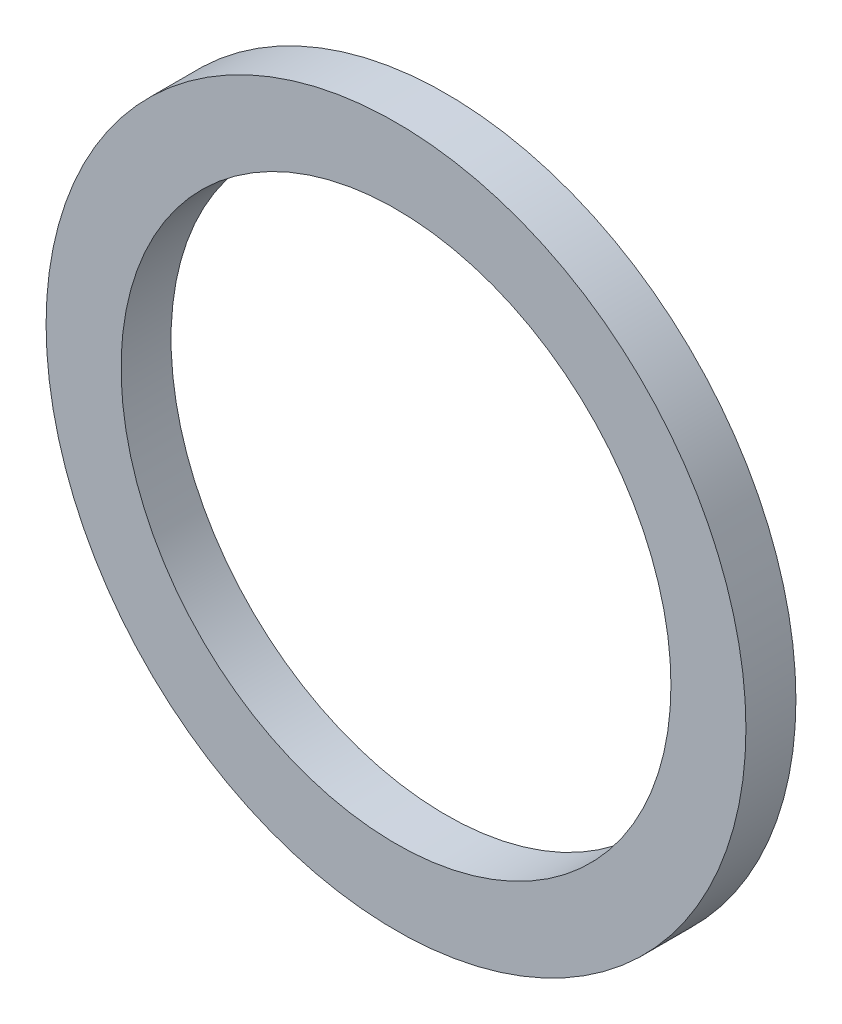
ISO-10303-21;
HEADER;
FILE_DESCRIPTION(('STEP AP214'),'2;1');
FILE_NAME('part.step','',(''),(''),'','','');
FILE_SCHEMA(('AUTOMOTIVE_DESIGN { 1 0 10303 214 1 1 1 1 }'));
ENDSEC;
DATA;
#1=APPLICATION_CONTEXT('core data for automotive mechanical design processes');
#2=APPLICATION_PROTOCOL_DEFINITION('international standard','automotive_design',2000,#1);
#3=PRODUCT_CONTEXT('',#1,'mechanical');
#4=PRODUCT('Part','Part','',(#3));
#5=PRODUCT_RELATED_PRODUCT_CATEGORY('part','',(#4));
#6=PRODUCT_DEFINITION_FORMATION('','',#4);
#7=PRODUCT_DEFINITION_CONTEXT('part definition',#1,'design');
#8=PRODUCT_DEFINITION('design','',#6,#7);
#9=PRODUCT_DEFINITION_SHAPE('','',#8);
#10=(LENGTH_UNIT() NAMED_UNIT(*) SI_UNIT(.MILLI.,.METRE.));
#11=(NAMED_UNIT(*) PLANE_ANGLE_UNIT() SI_UNIT($,.RADIAN.));
#12=(NAMED_UNIT(*) SI_UNIT($,.STERADIAN.) SOLID_ANGLE_UNIT());
#13=UNCERTAINTY_MEASURE_WITH_UNIT(LENGTH_MEASURE(1.E-05),#10,'distance_accuracy_value','');
#14=(GEOMETRIC_REPRESENTATION_CONTEXT(3) GLOBAL_UNCERTAINTY_ASSIGNED_CONTEXT((#13)) GLOBAL_UNIT_ASSIGNED_CONTEXT((#10,
#11,#12)) REPRESENTATION_CONTEXT('',''));
#15=CARTESIAN_POINT('',(0.,0.,0.));
#16=DIRECTION('',(0.,0.,1.));
#17=DIRECTION('',(1.,0.,0.));
#18=AXIS2_PLACEMENT_3D('',#15,#16,#17);
#19=CARTESIAN_POINT('',(0.,27.5,0.));
#20=DIRECTION('',(0.,0.,-1.));
#21=DIRECTION('',(-1.,0.,0.));
#22=AXIS2_PLACEMENT_3D('',#19,#20,#21);
#23=PLANE('',#22);
#24=CARTESIAN_POINT('',(0.,0.,0.));
#25=DIRECTION('',(0.,0.,1.));
#26=DIRECTION('',(1.,0.,0.));
#27=AXIS2_PLACEMENT_3D('',#24,#25,#26);
#28=CIRCLE('',#27,27.5);
#29=CARTESIAN_POINT('',(27.5,0.,0.));
#30=VERTEX_POINT('',#29);
#31=EDGE_CURVE('E45',#30,#30,#28,.T.);
#32=ORIENTED_EDGE('',*,*,#31,.F.);
#33=EDGE_LOOP('',(#32));
#34=FACE_BOUND('',#33,.T.);
#35=CARTESIAN_POINT('',(0.,0.,0.));
#36=DIRECTION('',(0.,0.,1.));
#37=DIRECTION('',(1.,0.,0.));
#38=AXIS2_PLACEMENT_3D('',#35,#36,#37);
#39=CIRCLE('',#38,35.);
#40=CARTESIAN_POINT('',(35.,0.,0.));
#41=VERTEX_POINT('',#40);
#42=EDGE_CURVE('E10',#41,#41,#39,.T.);
#43=ORIENTED_EDGE('',*,*,#42,.T.);
#44=EDGE_LOOP('',(#43));
#45=FACE_BOUND('',#44,.T.);
#46=ADVANCED_FACE('F31',(#34,#45),#23,.F.);
#47=CARTESIAN_POINT('',(0.,0.,0.));
#48=DIRECTION('',(0.,0.,1.));
#49=DIRECTION('',(1.,0.,0.));
#50=AXIS2_PLACEMENT_3D('',#47,#48,#49);
#51=CYLINDRICAL_SURFACE('',#50,35.);
#52=ORIENTED_EDGE('',*,*,#42,.F.);
#53=EDGE_LOOP('',(#52));
#54=FACE_BOUND('',#53,.T.);
#55=CARTESIAN_POINT('',(0.,0.,-5.));
#56=DIRECTION('',(0.,0.,1.));
#57=DIRECTION('',(1.,0.,0.));
#58=AXIS2_PLACEMENT_3D('',#55,#56,#57);
#59=CIRCLE('',#58,35.);
#60=CARTESIAN_POINT('',(35.,0.,-5.));
#61=VERTEX_POINT('',#60);
#62=EDGE_CURVE('E37',#61,#61,#59,.T.);
#63=ORIENTED_EDGE('',*,*,#62,.T.);
#64=EDGE_LOOP('',(#63));
#65=FACE_BOUND('',#64,.T.);
#66=ADVANCED_FACE('F54',(#54,#65),#51,.T.);
#67=CARTESIAN_POINT('',(0.,35.,-5.));
#68=DIRECTION('',(0.,0.,1.));
#69=DIRECTION('',(1.,0.,0.));
#70=AXIS2_PLACEMENT_3D('',#67,#68,#69);
#71=PLANE('',#70);
#72=ORIENTED_EDGE('',*,*,#62,.F.);
#73=EDGE_LOOP('',(#72));
#74=FACE_BOUND('',#73,.T.);
#75=CARTESIAN_POINT('',(0.,0.,-5.));
#76=DIRECTION('',(0.,0.,1.));
#77=DIRECTION('',(1.,0.,0.));
#78=AXIS2_PLACEMENT_3D('',#75,#76,#77);
#79=CIRCLE('',#78,27.5);
#80=CARTESIAN_POINT('',(27.5,0.,-5.));
#81=VERTEX_POINT('',#80);
#82=EDGE_CURVE('E41',#81,#81,#79,.T.);
#83=ORIENTED_EDGE('',*,*,#82,.T.);
#84=EDGE_LOOP('',(#83));
#85=FACE_BOUND('',#84,.T.);
#86=ADVANCED_FACE('F58',(#74,#85),#71,.F.);
#87=CARTESIAN_POINT('',(0.,0.,0.));
#88=DIRECTION('',(0.,0.,1.));
#89=DIRECTION('',(1.,0.,0.));
#90=AXIS2_PLACEMENT_3D('',#87,#88,#89);
#91=CYLINDRICAL_SURFACE('',#90,27.5);
#92=ORIENTED_EDGE('',*,*,#82,.F.);
#93=EDGE_LOOP('',(#92));
#94=FACE_BOUND('',#93,.T.);
#95=ORIENTED_EDGE('',*,*,#31,.T.);
#96=EDGE_LOOP('',(#95));
#97=FACE_BOUND('',#96,.T.);
#98=ADVANCED_FACE('F51',(#94,#97),#91,.F.);
#99=CLOSED_SHELL('',(#46,#66,#86,#98));
#100=MANIFOLD_SOLID_BREP('B2',#99);
#101=ADVANCED_BREP_SHAPE_REPRESENTATION('',(#18,#100),#14);
#102=SHAPE_DEFINITION_REPRESENTATION(#9,#101);
ENDSEC;
END-ISO-10303-21;
